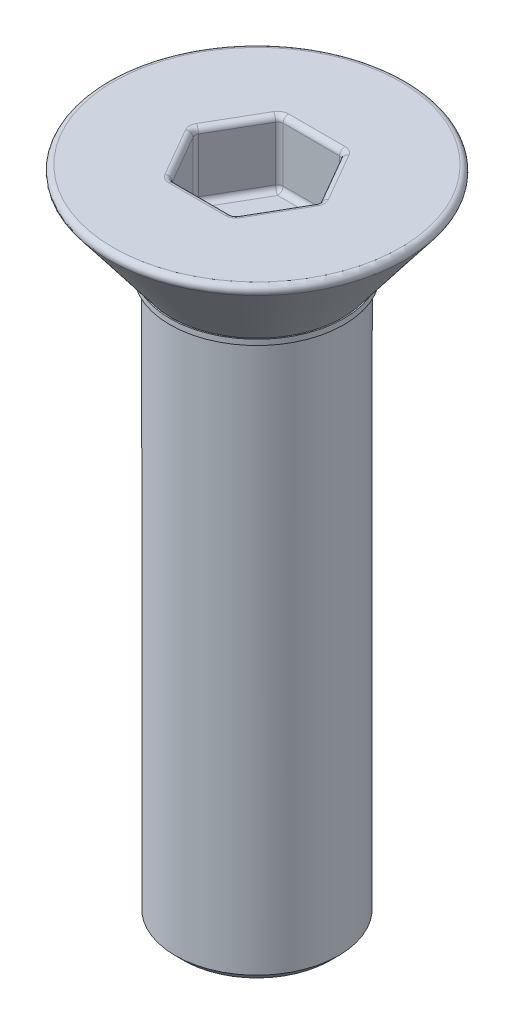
from build123d import *

# Parameters (mm, degrees)
CUT_EXTRUDE1_DEPTH = 1.2
CHAMFER1_SIZE      = 0.15
FILLET1_R          = 0.1
SKETCH_1_R         = 1.6
EXTRUDE_1771_DEPTH = 0.1


with BuildPart() as part:
    # Sketch1 → Revolve1 (revolve)
    with BuildSketch(Plane(origin=(0, 0, 0), x_dir=(0, 0, -1), z_dir=(1, 0, 0))):
        Polygon((-2.845, 1.75), (-1.5, 0), (-1.5, -10.25), (0, -10.25), (0, 1.75), align=None)
    revolve(axis=Axis((0, 1.75, 0), (0, -1, 0)))

    # Sketch2 → Cut-Extrude1 (cut)
    with BuildSketch(Plane(origin=(0, 1.75, 0), x_dir=(1, 0, 0), z_dir=(0, 1, 0))):
        Polygon((1.154700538, 0), (0.577350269, 1), (-0.577350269, 1), (-1.154700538, 0), (-0.577350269, -1), (0.577350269, -1), align=None)
    extrude(amount=-CUT_EXTRUDE1_DEPTH, mode=Mode.SUBTRACT)

    # Chamfer1
    chamfer1_edges = [part.edges().sort_by_distance(p)[0] for p in [
        (0, -10.25, -1.5),
    ]]
    chamfer(chamfer1_edges, length=CHAMFER1_SIZE)

    # Fillet1
    fillet1_edges = [part.edges().sort_by_distance(p)[0] for p in [
        (0.866025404, 0.55, 0.5),
        (1.154700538, 1.15, 0),
        (0, 0.55, 1),
        (0.577350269, 1.15, 1),
        (-0.866025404, 0.55, 0.5),
        (-0.577350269, 1.15, 1),
        (-0.866025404, 0.55, -0.5),
        (-1.154700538, 1.15, 0),
        (0, 0.55, -1),
        (-0.577350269, 1.15, -1),
        (0.866025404, 0.55, -0.5),
        (0.577350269, 1.15, -1),
        (0.866025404, 1.75, 0.5),
        (0.866025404, 1.75, -0.5),
        (0, 1.75, -1),
        (-0.866025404, 1.75, -0.5),
        (-0.866025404, 1.75, 0.5),
        (0, 1.75, 1),
        (0, 1.75, -2.845),
    ]]
    fillet(fillet1_edges, radius=FILLET1_R)


with BuildPart() as body_2:
    # Sketch 1 → Extrude 1771 (new body)
    with BuildSketch(Plane(origin=(0, 0, 0), x_dir=(1, 0, 0), z_dir=(0, 1, 0))):
        with Locations(Location((0, 0, 0), (0, 0, 270))):
            Circle(SKETCH_1_R)
    extrude(amount=EXTRUDE_1771_DEPTH)


solid = Compound([part.part, body_2.part])
